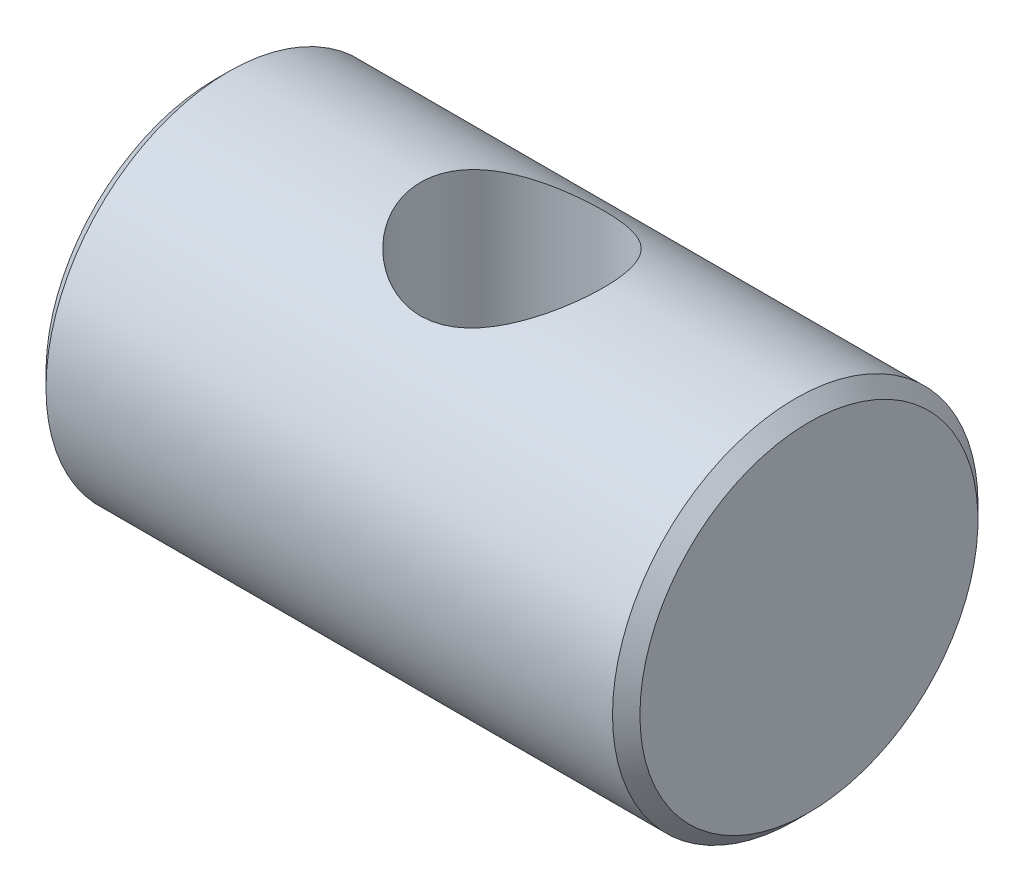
ISO-10303-21;
HEADER;
FILE_DESCRIPTION(('STEP AP214'),'2;1');
FILE_NAME('part.step','',(''),(''),'','','');
FILE_SCHEMA(('AUTOMOTIVE_DESIGN { 1 0 10303 214 1 1 1 1 }'));
ENDSEC;
DATA;
#1=APPLICATION_CONTEXT('core data for automotive mechanical design processes');
#2=APPLICATION_PROTOCOL_DEFINITION('international standard','automotive_design',2000,#1);
#3=PRODUCT_CONTEXT('',#1,'mechanical');
#4=PRODUCT('Part','Part','',(#3));
#5=PRODUCT_RELATED_PRODUCT_CATEGORY('part','',(#4));
#6=PRODUCT_DEFINITION_FORMATION('','',#4);
#7=PRODUCT_DEFINITION_CONTEXT('part definition',#1,'design');
#8=PRODUCT_DEFINITION('design','',#6,#7);
#9=PRODUCT_DEFINITION_SHAPE('','',#8);
#10=(LENGTH_UNIT() NAMED_UNIT(*) SI_UNIT(.MILLI.,.METRE.));
#11=(NAMED_UNIT(*) PLANE_ANGLE_UNIT() SI_UNIT($,.RADIAN.));
#12=(NAMED_UNIT(*) SI_UNIT($,.STERADIAN.) SOLID_ANGLE_UNIT());
#13=UNCERTAINTY_MEASURE_WITH_UNIT(LENGTH_MEASURE(1.E-05),#10,'distance_accuracy_value','');
#14=(GEOMETRIC_REPRESENTATION_CONTEXT(3) GLOBAL_UNCERTAINTY_ASSIGNED_CONTEXT((#13)) GLOBAL_UNIT_ASSIGNED_CONTEXT((#10,
#11,#12)) REPRESENTATION_CONTEXT('',''));
#15=CARTESIAN_POINT('',(0.,0.,0.));
#16=DIRECTION('',(0.,0.,1.));
#17=DIRECTION('',(1.,0.,0.));
#18=AXIS2_PLACEMENT_3D('',#15,#16,#17);
#19=CARTESIAN_POINT('',(6.5,3.7,0.));
#20=DIRECTION('',(-1.,0.,0.));
#21=DIRECTION('',(0.,0.,1.));
#22=AXIS2_PLACEMENT_3D('',#19,#20,#21);
#23=PLANE('',#22);
#24=CARTESIAN_POINT('',(6.50000000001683,0.,0.));
#25=DIRECTION('',(-1.,0.,0.));
#26=DIRECTION('',(0.,0.,1.));
#27=AXIS2_PLACEMENT_3D('',#24,#25,#26);
#28=CIRCLE('',#27,3.70000000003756);
#29=CARTESIAN_POINT('',(6.50000000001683,0.,3.70000000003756));
#30=VERTEX_POINT('',#29);
#31=EDGE_CURVE('E62',#30,#30,#28,.T.);
#32=ORIENTED_EDGE('',*,*,#31,.F.);
#33=EDGE_LOOP('',(#32));
#34=FACE_BOUND('',#33,.T.);
#35=ADVANCED_FACE('F12',(#34),#23,.F.);
#36=CARTESIAN_POINT('',(-6.5,0.,0.));
#37=DIRECTION('',(1.,0.,0.));
#38=DIRECTION('',(0.,0.,-1.));
#39=AXIS2_PLACEMENT_3D('',#36,#37,#38);
#40=PLANE('',#39);
#41=CARTESIAN_POINT('',(-6.49999999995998,0.,0.));
#42=DIRECTION('',(1.,0.,0.));
#43=DIRECTION('',(0.,1.,0.));
#44=AXIS2_PLACEMENT_3D('',#41,#42,#43);
#45=CIRCLE('',#44,3.70000000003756);
#46=CARTESIAN_POINT('',(-6.49999999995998,3.70000000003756,0.));
#47=VERTEX_POINT('',#46);
#48=EDGE_CURVE('E64',#47,#47,#45,.T.);
#49=ORIENTED_EDGE('',*,*,#48,.F.);
#50=EDGE_LOOP('',(#49));
#51=FACE_BOUND('',#50,.T.);
#52=ADVANCED_FACE('F53',(#51),#40,.F.);
#53=CARTESIAN_POINT('',(6.19999999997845,0.,0.));
#54=DIRECTION('',(-1.,0.,0.));
#55=DIRECTION('',(0.,0.,1.));
#56=AXIS2_PLACEMENT_3D('',#53,#54,#55);
#57=CONICAL_SURFACE('',#56,4.0000000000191,0.78539816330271);
#58=CARTESIAN_POINT('',(6.2,0.,0.));
#59=DIRECTION('',(1.,0.,0.));
#60=DIRECTION('',(0.,0.,-1.));
#61=AXIS2_PLACEMENT_3D('',#58,#59,#60);
#62=CIRCLE('',#61,4.);
#63=CARTESIAN_POINT('',(6.2,0.,-4.));
#64=VERTEX_POINT('',#63);
#65=EDGE_CURVE('E31',#64,#64,#62,.F.);
#66=ORIENTED_EDGE('',*,*,#65,.F.);
#67=EDGE_LOOP('',(#66));
#68=FACE_BOUND('',#67,.T.);
#69=ORIENTED_EDGE('',*,*,#31,.T.);
#70=EDGE_LOOP('',(#69));
#71=FACE_BOUND('',#70,.T.);
#72=ADVANCED_FACE('F58',(#68,#71),#57,.T.);
#73=CARTESIAN_POINT('',(-6.20000000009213,0.,0.));
#74=DIRECTION('',(1.,0.,0.));
#75=DIRECTION('',(0.,1.,0.));
#76=AXIS2_PLACEMENT_3D('',#73,#74,#75);
#77=CONICAL_SURFACE('',#76,3.99999999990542,0.785398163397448);
#78=ORIENTED_EDGE('',*,*,#48,.T.);
#79=EDGE_LOOP('',(#78));
#80=FACE_BOUND('',#79,.T.);
#81=CARTESIAN_POINT('',(-6.2,0.,0.));
#82=DIRECTION('',(1.,0.,0.));
#83=DIRECTION('',(0.,0.,-1.));
#84=AXIS2_PLACEMENT_3D('',#81,#82,#83);
#85=CIRCLE('',#84,4.);
#86=CARTESIAN_POINT('',(-6.2,0.,-4.));
#87=VERTEX_POINT('',#86);
#88=EDGE_CURVE('E27',#87,#87,#85,.T.);
#89=ORIENTED_EDGE('',*,*,#88,.F.);
#90=EDGE_LOOP('',(#89));
#91=FACE_BOUND('',#90,.T.);
#92=ADVANCED_FACE('F50',(#80,#91),#77,.T.);
#93=CARTESIAN_POINT('',(6.5,0.,0.));
#94=DIRECTION('',(1.,0.,0.));
#95=DIRECTION('',(0.,0.,-1.));
#96=AXIS2_PLACEMENT_3D('',#93,#94,#95);
#97=CYLINDRICAL_SURFACE('',#96,4.);
#98=CARTESIAN_POINT('',(2.,-4.,0.));
#99=CARTESIAN_POINT('',(1.99999339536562,-3.99999426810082,0.105143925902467));
#100=CARTESIAN_POINT('',(1.99165985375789,-3.99580982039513,0.210413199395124));
#101=CARTESIAN_POINT('',(1.95869423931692,-3.97948312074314,0.417840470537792));
#102=CARTESIAN_POINT('',(1.93403121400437,-3.96732575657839,0.519992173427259));
#103=CARTESIAN_POINT('',(1.86961238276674,-3.93632558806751,0.717867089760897));
#104=CARTESIAN_POINT('',(1.82991523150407,-3.91750878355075,0.813613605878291));
#105=CARTESIAN_POINT('',(1.73685875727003,-3.87491553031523,0.996945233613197));
#106=CARTESIAN_POINT('',(1.68350051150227,-3.85113947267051,1.08453098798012));
#107=CARTESIAN_POINT('',(1.56096550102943,-3.79912516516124,1.25501563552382));
#108=CARTESIAN_POINT('',(1.49102704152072,-3.77070398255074,1.33731042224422));
#109=CARTESIAN_POINT('',(1.33895704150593,-3.71319940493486,1.48955888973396));
#110=CARTESIAN_POINT('',(1.25681629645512,-3.68411552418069,1.55950316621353));
#111=CARTESIAN_POINT('',(1.07503330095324,-3.62597902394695,1.69050400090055));
#112=CARTESIAN_POINT('',(0.974527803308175,-3.59710373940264,1.75045067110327));
#113=CARTESIAN_POINT('',(0.763265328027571,-3.54571957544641,1.85233645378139));
#114=CARTESIAN_POINT('',(0.652515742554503,-3.52320615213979,1.89428842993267));
#115=CARTESIAN_POINT('',(0.430669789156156,-3.48915734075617,1.95626488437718));
#116=CARTESIAN_POINT('',(0.319991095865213,-3.47704543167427,1.97745171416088));
#117=CARTESIAN_POINT('',(0.0960423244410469,-3.46363779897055,2.00085398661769));
#118=CARTESIAN_POINT('',(-0.0172250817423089,-3.46233138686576,2.00308817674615));
#119=CARTESIAN_POINT('',(-0.228572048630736,-3.47021860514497,1.98937457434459));
#120=CARTESIAN_POINT('',(-0.3268480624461,-3.47817527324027,1.97556911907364));
#121=CARTESIAN_POINT('',(-0.519443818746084,-3.50152457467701,1.93387969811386));
#122=CARTESIAN_POINT('',(-0.613762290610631,-3.51691957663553,1.9059912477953));
#123=CARTESIAN_POINT('',(-0.798458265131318,-3.55374952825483,1.83641956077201));
#124=CARTESIAN_POINT('',(-0.888692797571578,-3.57531681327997,1.79443013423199));
#125=CARTESIAN_POINT('',(-1.06126858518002,-3.62206808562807,1.698083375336));
#126=CARTESIAN_POINT('',(-1.14360627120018,-3.64725369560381,1.64372048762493));
#127=CARTESIAN_POINT('',(-1.30904250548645,-3.70226315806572,1.51613210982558));
#128=CARTESIAN_POINT('',(-1.39091374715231,-3.73227020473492,1.44138891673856));
#129=CARTESIAN_POINT('',(-1.5414708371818,-3.79095246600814,1.27911115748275));
#130=CARTESIAN_POINT('',(-1.61015038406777,-3.81962703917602,1.19157051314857));
#131=CARTESIAN_POINT('',(-1.73537132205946,-3.87403974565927,1.0010330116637));
#132=CARTESIAN_POINT('',(-1.79120094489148,-3.89957968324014,0.897507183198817));
#133=CARTESIAN_POINT('',(-1.88419405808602,-3.94315762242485,0.680932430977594));
#134=CARTESIAN_POINT('',(-1.92137237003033,-3.96120157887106,0.567891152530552));
#135=CARTESIAN_POINT('',(-1.97295080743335,-3.98648667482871,0.345532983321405));
#136=CARTESIAN_POINT('',(-1.98898247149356,-3.9944987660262,0.236683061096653));
#137=CARTESIAN_POINT('',(-2.00292946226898,-4.00146026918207,0.0175591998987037));
#138=CARTESIAN_POINT('',(-2.00085337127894,-4.00041397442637,-0.0927140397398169));
#139=CARTESIAN_POINT('',(-1.97958662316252,-3.9898238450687,-0.302465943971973));
#140=CARTESIAN_POINT('',(-1.96173493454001,-3.98094491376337,-0.402118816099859));
#141=CARTESIAN_POINT('',(-1.91152385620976,-3.95644342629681,-0.596813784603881));
#142=CARTESIAN_POINT('',(-1.87916286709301,-3.94082012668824,-0.691855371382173));
#143=CARTESIAN_POINT('',(-1.80000306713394,-3.90368502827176,-0.877777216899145));
#144=CARTESIAN_POINT('',(-1.75281789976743,-3.88201763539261,-0.968460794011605));
#145=CARTESIAN_POINT('',(-1.64578492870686,-3.83487948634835,-1.14092272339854));
#146=CARTESIAN_POINT('',(-1.58593173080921,-3.80940711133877,-1.22269725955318));
#147=CARTESIAN_POINT('',(-1.44847914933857,-3.75416442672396,-1.38353537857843));
#148=CARTESIAN_POINT('',(-1.36971426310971,-3.72421769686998,-1.46154415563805));
#149=CARTESIAN_POINT('',(-1.20014969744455,-3.6652478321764,-1.60371264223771));
#150=CARTESIAN_POINT('',(-1.10934176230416,-3.63622534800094,-1.66786277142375));
#151=CARTESIAN_POINT('',(-0.912712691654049,-3.58102384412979,-1.78341582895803));
#152=CARTESIAN_POINT('',(-0.806377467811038,-3.55505059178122,-1.8340509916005));
#153=CARTESIAN_POINT('',(-0.584979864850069,-3.51148144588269,-1.91616565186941));
#154=CARTESIAN_POINT('',(-0.469928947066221,-3.493874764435,-1.94766983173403));
#155=CARTESIAN_POINT('',(-0.246179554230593,-3.47123002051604,-1.98772337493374));
#156=CARTESIAN_POINT('',(-0.137931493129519,-3.4651476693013,-1.9981859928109));
#157=CARTESIAN_POINT('',(0.0788941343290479,-3.46330709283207,-2.00137830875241));
#158=CARTESIAN_POINT('',(0.187471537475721,-3.4675443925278,-1.99411569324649));
#159=CARTESIAN_POINT('',(0.390967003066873,-3.48475724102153,-1.96385225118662));
#160=CARTESIAN_POINT('',(0.486200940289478,-3.49686188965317,-1.94241662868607));
#161=CARTESIAN_POINT('',(0.671616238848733,-3.52742032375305,-1.88635071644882));
#162=CARTESIAN_POINT('',(0.761795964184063,-3.54587615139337,-1.85171618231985));
#163=CARTESIAN_POINT('',(0.941249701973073,-3.58857060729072,-1.76763149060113));
#164=CARTESIAN_POINT('',(1.03005580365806,-3.61311444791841,-1.7173422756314));
#165=CARTESIAN_POINT('',(1.19854907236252,-3.66470663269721,-1.60430194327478));
#166=CARTESIAN_POINT('',(1.27823146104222,-3.69175627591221,-1.54154434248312));
#167=CARTESIAN_POINT('',(1.43628396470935,-3.74924646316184,-1.39640665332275));
#168=CARTESIAN_POINT('',(1.51331820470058,-3.77969966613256,-1.31256884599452));
#169=CARTESIAN_POINT('',(1.65252596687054,-3.83755504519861,-1.1323096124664));
#170=CARTESIAN_POINT('',(1.71469147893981,-3.8649555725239,-1.0358814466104));
#171=CARTESIAN_POINT('',(1.82247272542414,-3.91396019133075,-0.831863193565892));
#172=CARTESIAN_POINT('',(1.86796833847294,-3.93552192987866,-0.724199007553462));
#173=CARTESIAN_POINT('',(1.93961633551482,-3.97002682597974,-0.501484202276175));
#174=CARTESIAN_POINT('',(1.96582369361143,-3.98299446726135,-0.386455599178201));
#175=CARTESIAN_POINT('',(1.98779482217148,-3.99390923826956,-0.225203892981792));
#176=CARTESIAN_POINT('',(1.99236528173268,-3.99618730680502,-0.180323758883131));
#177=CARTESIAN_POINT('',(1.99846933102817,-3.99923393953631,-0.0903034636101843));
#178=CARTESIAN_POINT('',(2.00000283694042,-4.00000246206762,-0.0451632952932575));
#179=CARTESIAN_POINT('',(2.,-4.,0.));
#180=B_SPLINE_CURVE_WITH_KNOTS('',3,(#98,#99,#100,#101,#102,#103,#104,#105,#106,#107,#108,#109,
#110,#111,#112,#113,#114,#115,#116,#117,#118,#119,#120,#121,#122,#123,#124,#125,#126,#127,#128,
#129,#130,#131,#132,#133,#134,#135,#136,#137,#138,#139,#140,#141,#142,#143,#144,#145,#146,#147,
#148,#149,#150,#151,#152,#153,#154,#155,#156,#157,#158,#159,#160,#161,#162,#163,#164,#165,#166,
#167,#168,#169,#170,#171,#172,#173,#174,#175,#176,#177,#178,#179),.UNSPECIFIED.,.T.,.F.,(4,2,2,
2,2,2,2,2,2,2,2,2,2,2,2,2,2,2,2,2,2,2,2,2,2,2,2,2,2,2,2,2,2,2,2,2,2,2,2,2,4),(0.,
0.315248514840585,0.631096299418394,0.945724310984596,1.26032752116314,1.59396351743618,
1.92785247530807,2.28763452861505,2.64715895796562,2.98516024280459,3.32282714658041,
3.62011424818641,3.91749607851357,4.22180480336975,4.52625042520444,4.86929882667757,
5.21251069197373,5.57166044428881,5.93052433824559,6.25966580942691,6.58865129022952,
6.89213813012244,7.19565843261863,7.50785712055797,7.82018901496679,8.16319221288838,
8.50643177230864,8.86629364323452,9.22569023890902,9.55058615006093,9.87534119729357,
10.1691586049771,10.463070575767,10.7767291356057,11.0905512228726,11.4425048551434,
11.7946476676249,12.1492802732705,12.502898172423,12.6383056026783,12.7737167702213),.UNSPECIFIED.);
#181=CARTESIAN_POINT('',(2.,-4.,0.));
#182=VERTEX_POINT('',#181);
#183=EDGE_CURVE('E8',#182,#182,#180,.T.);
#184=ORIENTED_EDGE('',*,*,#183,.F.);
#185=EDGE_LOOP('',(#184));
#186=FACE_BOUND('',#185,.T.);
#187=CARTESIAN_POINT('',(0.,3.46410161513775,2.));
#188=CARTESIAN_POINT('',(0.104213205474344,3.46411185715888,1.99999158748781));
#189=CARTESIAN_POINT('',(0.208562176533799,3.46887633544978,1.99179963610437));
#190=CARTESIAN_POINT('',(0.414055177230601,3.48724701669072,1.95944672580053));
#191=CARTESIAN_POINT('',(0.515192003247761,3.50087179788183,1.93525221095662));
#192=CARTESIAN_POINT('',(0.710903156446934,3.53498701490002,1.8721998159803));
#193=CARTESIAN_POINT('',(0.80550925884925,3.55544089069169,1.83341988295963));
#194=CARTESIAN_POINT('',(0.986848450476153,3.60085327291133,1.74253507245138));
#195=CARTESIAN_POINT('',(1.07358111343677,3.62581202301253,1.69042947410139));
#196=CARTESIAN_POINT('',(1.24461144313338,3.67993738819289,1.569333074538));
#197=CARTESIAN_POINT('',(1.32811826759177,3.70928127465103,1.49930407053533));
#198=CARTESIAN_POINT('',(1.4828167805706,3.76743965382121,1.34650761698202));
#199=CARTESIAN_POINT('',(1.55400232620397,3.79625387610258,1.26373385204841));
#200=CARTESIAN_POINT('',(1.6867343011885,3.85242953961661,1.08097912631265));
#201=CARTESIAN_POINT('',(1.74730753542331,3.87956212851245,0.980214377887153));
#202=CARTESIAN_POINT('',(1.85028170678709,3.92701512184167,0.768314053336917));
#203=CARTESIAN_POINT('',(1.8926941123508,3.94733982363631,0.657185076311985));
#204=CARTESIAN_POINT('',(1.95500932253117,3.97760922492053,0.436089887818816));
#205=CARTESIAN_POINT('',(1.9762990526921,3.9881896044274,0.326603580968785));
#206=CARTESIAN_POINT('',(2.00033223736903,4.00015167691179,0.10514125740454));
#207=CARTESIAN_POINT('',(2.00308691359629,4.00153893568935,-0.00683321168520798));
#208=CARTESIAN_POINT('',(1.99050665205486,3.99525963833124,-0.219665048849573));
#209=CARTESIAN_POINT('',(1.97672396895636,3.98836991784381,-0.320642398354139));
#210=CARTESIAN_POINT('',(1.93423831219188,3.96748490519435,-0.518627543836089));
#211=CARTESIAN_POINT('',(1.90553422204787,3.95348908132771,-0.615635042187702));
#212=CARTESIAN_POINT('',(1.83383486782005,3.91943166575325,-0.80461878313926));
#213=CARTESIAN_POINT('',(1.79064737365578,3.89928883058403,-0.896506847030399));
#214=CARTESIAN_POINT('',(1.6914731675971,3.8547529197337,-1.07195360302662));
#215=CARTESIAN_POINT('',(1.63548187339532,3.83035832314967,-1.15550929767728));
#216=CARTESIAN_POINT('',(1.50620929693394,3.7768878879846,-1.3203473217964));
#217=CARTESIAN_POINT('',(1.43179394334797,3.7475875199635,-1.40066815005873));
#218=CARTESIAN_POINT('',(1.27082055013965,3.68908681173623,-1.54820874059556));
#219=CARTESIAN_POINT('',(1.18425325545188,3.65988656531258,-1.61541842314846));
#220=CARTESIAN_POINT('',(0.994703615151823,3.60288312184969,-1.73901066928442));
#221=CARTESIAN_POINT('',(0.891027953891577,3.57528639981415,-1.7944346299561));
#222=CARTESIAN_POINT('',(0.674124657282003,3.52750900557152,-1.88663822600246));
#223=CARTESIAN_POINT('',(0.560907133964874,3.50732060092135,-1.92343731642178));
#224=CARTESIAN_POINT('',(0.337570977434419,3.47889271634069,-1.97436042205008));
#225=CARTESIAN_POINT('',(0.227917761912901,3.46983311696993,-1.99005024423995));
#226=CARTESIAN_POINT('',(0.00719731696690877,3.46235838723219,-2.00303389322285));
#227=CARTESIAN_POINT('',(-0.103868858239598,3.46393573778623,-2.00034071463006));
#228=CARTESIAN_POINT('',(-0.311307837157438,3.4766867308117,-1.97807208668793));
#229=CARTESIAN_POINT('',(-0.407958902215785,3.48679175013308,-1.96037563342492));
#230=CARTESIAN_POINT('',(-0.596735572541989,3.51388043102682,-1.91139256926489));
#231=CARTESIAN_POINT('',(-0.688859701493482,3.53086632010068,-1.88010155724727));
#232=CARTESIAN_POINT('',(-0.870822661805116,3.57072444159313,-1.80329517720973));
#233=CARTESIAN_POINT('',(-0.960358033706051,3.59383286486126,-1.7571881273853));
#234=CARTESIAN_POINT('',(-1.13093854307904,3.643122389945,-1.65257412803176));
#235=CARTESIAN_POINT('',(-1.21197928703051,3.66930506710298,-1.59406080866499));
#236=CARTESIAN_POINT('',(-1.37395753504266,3.72575996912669,-1.45767433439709));
#237=CARTESIAN_POINT('',(-1.45359430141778,3.75613166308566,-1.37829054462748));
#238=CARTESIAN_POINT('',(-1.59882447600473,3.81468469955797,-1.20680899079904));
#239=CARTESIAN_POINT('',(-1.66441314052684,3.84286530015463,-1.11470694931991));
#240=CARTESIAN_POINT('',(-1.78114745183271,3.89482723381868,-0.917070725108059));
#241=CARTESIAN_POINT('',(-1.83186623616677,3.91847283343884,-0.811246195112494));
#242=CARTESIAN_POINT('',(-1.91427580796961,3.95766709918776,-0.591044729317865));
#243=CARTESIAN_POINT('',(-1.9459833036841,3.97322287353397,-0.476675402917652));
#244=CARTESIAN_POINT('',(-1.98673712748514,3.99335016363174,-0.253959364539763));
#245=CARTESIAN_POINT('',(-1.99759574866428,3.9987985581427,-0.146022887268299));
#246=CARTESIAN_POINT('',(-2.00168653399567,4.00084260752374,0.0702519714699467));
#247=CARTESIAN_POINT('',(-1.99492486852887,3.99744136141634,0.178590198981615));
#248=CARTESIAN_POINT('',(-1.96516717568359,3.98267937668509,0.38507598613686));
#249=CARTESIAN_POINT('',(-1.94327026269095,3.97185789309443,0.483424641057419));
#250=CARTESIAN_POINT('',(-1.88534604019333,3.94384187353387,0.674891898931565));
#251=CARTESIAN_POINT('',(-1.84931670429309,3.92664642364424,0.768009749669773));
#252=CARTESIAN_POINT('',(-1.7625457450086,3.88651861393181,0.950846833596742));
#253=CARTESIAN_POINT('',(-1.71124078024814,3.86337234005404,1.0402503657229));
#254=CARTESIAN_POINT('',(-1.59608471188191,3.81376266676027,1.20954920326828));
#255=CARTESIAN_POINT('',(-1.53222784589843,3.78729774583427,1.28944011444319));
#256=CARTESIAN_POINT('',(-1.38640336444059,3.73057218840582,1.44582833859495));
#257=CARTESIAN_POINT('',(-1.30326581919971,3.70019591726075,1.52119665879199));
#258=CARTESIAN_POINT('',(-1.12510777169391,3.64126158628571,1.65732528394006));
#259=CARTESIAN_POINT('',(-1.03007686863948,3.61270515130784,1.71807266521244));
#260=CARTESIAN_POINT('',(-0.826691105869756,3.55999186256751,1.82486714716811));
#261=CARTESIAN_POINT('',(-0.718010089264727,3.53600256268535,1.87038902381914));
#262=CARTESIAN_POINT('',(-0.549421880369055,3.5069621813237,1.92395929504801));
#263=CARTESIAN_POINT('',(-0.492352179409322,3.49844389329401,1.93935666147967));
#264=CARTESIAN_POINT('',(-0.376767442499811,3.48406059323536,1.96508069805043));
#265=CARTESIAN_POINT('',(-0.318253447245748,3.47819372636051,1.97541091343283));
#266=CARTESIAN_POINT('',(-0.21639921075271,3.47059023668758,1.9887293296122));
#267=CARTESIAN_POINT('',(-0.173266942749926,3.46816389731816,1.99295091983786));
#268=CARTESIAN_POINT('',(-0.0867643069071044,3.46491740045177,1.99858810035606));
#269=CARTESIAN_POINT('',(-0.0433939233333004,3.46409735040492,2.00000350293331));
#270=CARTESIAN_POINT('',(0.,3.46410161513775,2.));
#271=B_SPLINE_CURVE_WITH_KNOTS('',3,(#187,#188,#189,#190,#191,#192,#193,#194,#195,#196,#197,
#198,#199,#200,#201,#202,#203,#204,#205,#206,#207,#208,#209,#210,#211,#212,#213,#214,#215,#216,
#217,#218,#219,#220,#221,#222,#223,#224,#225,#226,#227,#228,#229,#230,#231,#232,#233,#234,#235,
#236,#237,#238,#239,#240,#241,#242,#243,#244,#245,#246,#247,#248,#249,#250,#251,#252,#253,#254,
#255,#256,#257,#258,#259,#260,#261,#262,#263,#264,#265,#266,#267,#268,#269,#270),.UNSPECIFIED.,
.T.,.F.,(4,2,2,2,2,2,2,2,2,2,2,2,2,2,2,2,2,2,2,2,2,2,2,2,2,2,2,2,2,2,2,2,2,2,2,2,2,2,2,2,2,4),
(0.,0.312464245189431,0.62558578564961,0.937057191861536,1.24854545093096,1.58572462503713,
1.92307142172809,2.28315784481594,2.64301653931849,2.97726969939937,3.31132047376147,
3.61632194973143,3.92134625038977,4.2305906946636,4.5399459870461,4.87854382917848,
5.21740096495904,5.57777683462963,5.93777548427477,6.2692458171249,6.60048186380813,
6.89548366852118,7.19058104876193,7.49934592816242,7.80826972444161,8.15613487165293,
8.50411729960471,8.86128362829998,9.2181355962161,9.5422454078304,9.8662417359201,
10.1688884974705,10.4715786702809,10.7872150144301,11.1029966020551,11.450204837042,
11.7977188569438,12.1562149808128,12.3351395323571,12.5139387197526,12.6440387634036,
12.7741475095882),.UNSPECIFIED.);
#272=CARTESIAN_POINT('',(0.,3.46410161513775,2.));
#273=VERTEX_POINT('',#272);
#274=EDGE_CURVE('E23',#273,#273,#271,.T.);
#275=ORIENTED_EDGE('',*,*,#274,.F.);
#276=EDGE_LOOP('',(#275));
#277=FACE_BOUND('',#276,.T.);
#278=ORIENTED_EDGE('',*,*,#88,.T.);
#279=EDGE_LOOP('',(#278));
#280=FACE_BOUND('',#279,.T.);
#281=ORIENTED_EDGE('',*,*,#65,.T.);
#282=EDGE_LOOP('',(#281));
#283=FACE_BOUND('',#282,.T.);
#284=ADVANCED_FACE('F39',(#186,#277,#280,#283),#97,.T.);
#285=CARTESIAN_POINT('',(0.,-4.,0.));
#286=DIRECTION('',(0.,1.,0.));
#287=DIRECTION('',(0.,0.,1.));
#288=AXIS2_PLACEMENT_3D('',#285,#286,#287);
#289=CYLINDRICAL_SURFACE('',#288,2.);
#290=ORIENTED_EDGE('',*,*,#183,.T.);
#291=EDGE_LOOP('',(#290));
#292=FACE_BOUND('',#291,.T.);
#293=ORIENTED_EDGE('',*,*,#274,.T.);
#294=EDGE_LOOP('',(#293));
#295=FACE_BOUND('',#294,.T.);
#296=ADVANCED_FACE('F42',(#292,#295),#289,.F.);
#297=CLOSED_SHELL('',(#35,#52,#72,#92,#284,#296));
#298=MANIFOLD_SOLID_BREP('B1',#297);
#299=ADVANCED_BREP_SHAPE_REPRESENTATION('',(#18,#298),#14);
#300=SHAPE_DEFINITION_REPRESENTATION(#9,#299);
ENDSEC;
END-ISO-10303-21;
